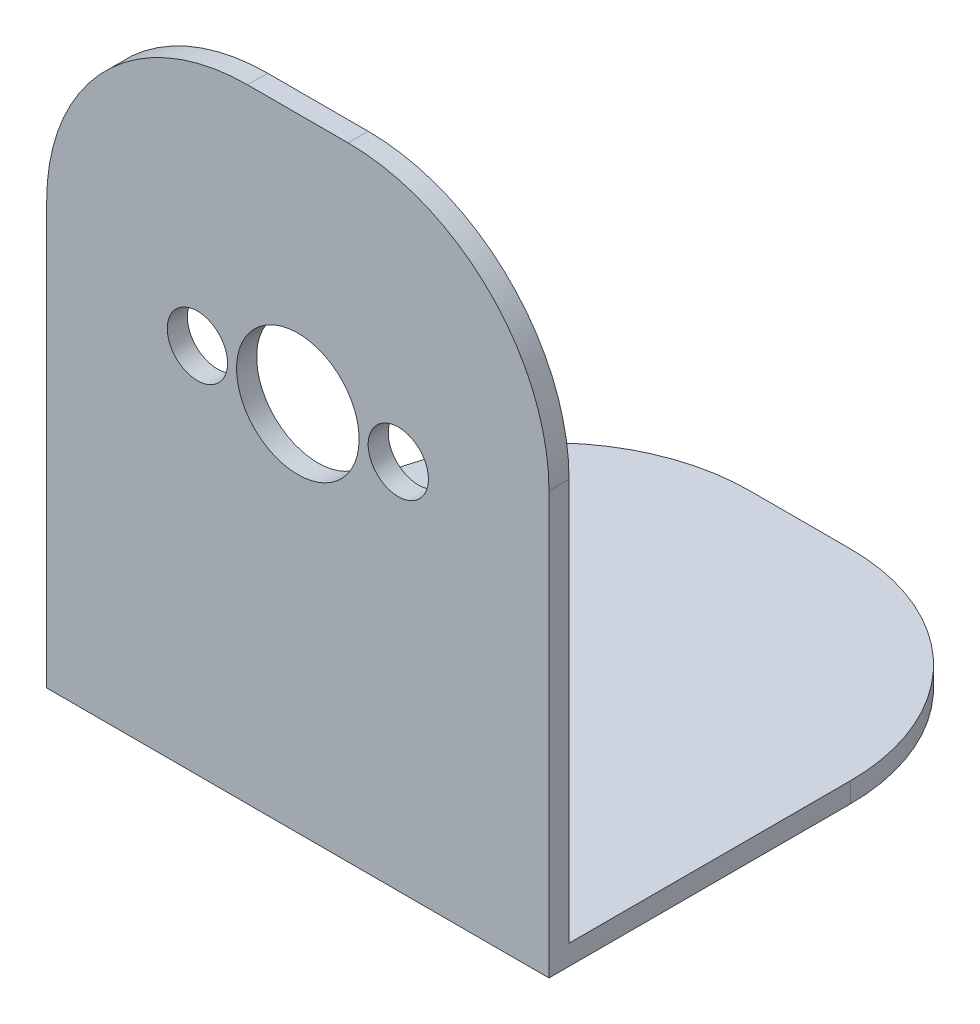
ISO-10303-21;
HEADER;
FILE_DESCRIPTION(('STEP AP214'),'2;1');
FILE_NAME('part.step','',(''),(''),'','','');
FILE_SCHEMA(('AUTOMOTIVE_DESIGN { 1 0 10303 214 1 1 1 1 }'));
ENDSEC;
DATA;
#1=APPLICATION_CONTEXT('core data for automotive mechanical design processes');
#2=APPLICATION_PROTOCOL_DEFINITION('international standard','automotive_design',2000,#1);
#3=PRODUCT_CONTEXT('',#1,'mechanical');
#4=PRODUCT('Part','Part','',(#3));
#5=PRODUCT_RELATED_PRODUCT_CATEGORY('part','',(#4));
#6=PRODUCT_DEFINITION_FORMATION('','',#4);
#7=PRODUCT_DEFINITION_CONTEXT('part definition',#1,'design');
#8=PRODUCT_DEFINITION('design','',#6,#7);
#9=PRODUCT_DEFINITION_SHAPE('','',#8);
#10=(LENGTH_UNIT() NAMED_UNIT(*) SI_UNIT(.MILLI.,.METRE.));
#11=(NAMED_UNIT(*) PLANE_ANGLE_UNIT() SI_UNIT($,.RADIAN.));
#12=(NAMED_UNIT(*) SI_UNIT($,.STERADIAN.) SOLID_ANGLE_UNIT());
#13=UNCERTAINTY_MEASURE_WITH_UNIT(LENGTH_MEASURE(1.E-05),#10,'distance_accuracy_value','');
#14=(GEOMETRIC_REPRESENTATION_CONTEXT(3) GLOBAL_UNCERTAINTY_ASSIGNED_CONTEXT((#13)) GLOBAL_UNIT_ASSIGNED_CONTEXT((#10,
#11,#12)) REPRESENTATION_CONTEXT('',''));
#15=CARTESIAN_POINT('',(0.,0.,0.));
#16=DIRECTION('',(0.,0.,1.));
#17=DIRECTION('',(1.,0.,0.));
#18=AXIS2_PLACEMENT_3D('',#15,#16,#17);
#19=CARTESIAN_POINT('',(0.,30.,1.));
#20=DIRECTION('',(0.,0.,-1.));
#21=DIRECTION('',(-1.,0.,0.));
#22=AXIS2_PLACEMENT_3D('',#19,#20,#21);
#23=PLANE('',#22);
#24=CARTESIAN_POINT('',(17.5,17.5,1.));
#25=DIRECTION('',(0.,0.,1.));
#26=DIRECTION('',(1.,0.,0.));
#27=AXIS2_PLACEMENT_3D('',#24,#25,#26);
#28=CIRCLE('',#27,1.5);
#29=CARTESIAN_POINT('',(19.,17.5,1.));
#30=VERTEX_POINT('',#29);
#31=EDGE_CURVE('E151',#30,#30,#28,.T.);
#32=ORIENTED_EDGE('',*,*,#31,.F.);
#33=EDGE_LOOP('',(#32));
#34=FACE_BOUND('',#33,.T.);
#35=DIRECTION('',(-1.,0.,0.));
#36=VECTOR('',#35,1.);
#37=CARTESIAN_POINT('',(0.,30.,1.));
#38=LINE('',#37,#36);
#39=CARTESIAN_POINT('',(15.,30.,1.));
#40=VERTEX_POINT('',#39);
#41=CARTESIAN_POINT('',(10.,30.,1.));
#42=VERTEX_POINT('',#41);
#43=EDGE_CURVE('E127',#40,#42,#38,.T.);
#44=ORIENTED_EDGE('',*,*,#43,.T.);
#45=CARTESIAN_POINT('',(10.,20.,1.));
#46=DIRECTION('',(0.,0.,-1.));
#47=DIRECTION('',(-1.,0.,0.));
#48=AXIS2_PLACEMENT_3D('',#45,#46,#47);
#49=CIRCLE('',#48,10.);
#50=CARTESIAN_POINT('',(0.,20.,1.));
#51=VERTEX_POINT('',#50);
#52=EDGE_CURVE('E11',#42,#51,#49,.F.);
#53=ORIENTED_EDGE('',*,*,#52,.T.);
#54=DIRECTION('',(0.,-1.,0.));
#55=VECTOR('',#54,1.);
#56=CARTESIAN_POINT('',(0.,0.,1.));
#57=LINE('',#56,#55);
#58=CARTESIAN_POINT('',(0.,-1.,1.));
#59=VERTEX_POINT('',#58);
#60=EDGE_CURVE('E128',#51,#59,#57,.T.);
#61=ORIENTED_EDGE('',*,*,#60,.T.);
#62=DIRECTION('',(-1.,0.,0.));
#63=VECTOR('',#62,1.);
#64=CARTESIAN_POINT('',(0.,-1.,1.));
#65=LINE('',#64,#63);
#66=CARTESIAN_POINT('',(25.,-1.,1.));
#67=VERTEX_POINT('',#66);
#68=EDGE_CURVE('E112',#67,#59,#65,.T.);
#69=ORIENTED_EDGE('',*,*,#68,.F.);
#70=DIRECTION('',(0.,1.,0.));
#71=VECTOR('',#70,1.);
#72=CARTESIAN_POINT('',(25.,0.,1.));
#73=LINE('',#72,#71);
#74=CARTESIAN_POINT('',(25.,20.,1.));
#75=VERTEX_POINT('',#74);
#76=EDGE_CURVE('E122',#67,#75,#73,.T.);
#77=ORIENTED_EDGE('',*,*,#76,.T.);
#78=CARTESIAN_POINT('',(15.,20.,1.));
#79=DIRECTION('',(0.,0.,-1.));
#80=DIRECTION('',(-1.,0.,0.));
#81=AXIS2_PLACEMENT_3D('',#78,#79,#80);
#82=CIRCLE('',#81,10.);
#83=EDGE_CURVE('E38',#75,#40,#82,.F.);
#84=ORIENTED_EDGE('',*,*,#83,.T.);
#85=EDGE_LOOP('',(#44,#53,#61,#69,#77,#84));
#86=FACE_BOUND('',#85,.T.);
#87=CARTESIAN_POINT('',(12.5,17.5,1.));
#88=DIRECTION('',(0.,0.,1.));
#89=DIRECTION('',(1.,0.,0.));
#90=AXIS2_PLACEMENT_3D('',#87,#88,#89);
#91=CIRCLE('',#90,3.05);
#92=CARTESIAN_POINT('',(15.55,17.5,1.));
#93=VERTEX_POINT('',#92);
#94=EDGE_CURVE('E157',#93,#93,#91,.T.);
#95=ORIENTED_EDGE('',*,*,#94,.F.);
#96=EDGE_LOOP('',(#95));
#97=FACE_BOUND('',#96,.T.);
#98=CARTESIAN_POINT('',(7.5,17.5,1.));
#99=DIRECTION('',(0.,0.,1.));
#100=DIRECTION('',(1.,0.,0.));
#101=AXIS2_PLACEMENT_3D('',#98,#99,#100);
#102=CIRCLE('',#101,1.5);
#103=CARTESIAN_POINT('',(9.,17.5,1.));
#104=VERTEX_POINT('',#103);
#105=EDGE_CURVE('E135',#104,#104,#102,.T.);
#106=ORIENTED_EDGE('',*,*,#105,.F.);
#107=EDGE_LOOP('',(#106));
#108=FACE_BOUND('',#107,.T.);
#109=ADVANCED_FACE('F30',(#34,#86,#97,#108),#23,.F.);
#110=CARTESIAN_POINT('',(0.,30.,0.));
#111=DIRECTION('',(0.,0.,-1.));
#112=DIRECTION('',(-1.,0.,0.));
#113=AXIS2_PLACEMENT_3D('',#110,#111,#112);
#114=PLANE('',#113);
#115=CARTESIAN_POINT('',(17.5,17.5,0.));
#116=DIRECTION('',(0.,0.,1.));
#117=DIRECTION('',(1.,0.,0.));
#118=AXIS2_PLACEMENT_3D('',#115,#116,#117);
#119=CIRCLE('',#118,1.5);
#120=CARTESIAN_POINT('',(19.,17.5,0.));
#121=VERTEX_POINT('',#120);
#122=EDGE_CURVE('E149',#121,#121,#119,.T.);
#123=ORIENTED_EDGE('',*,*,#122,.T.);
#124=EDGE_LOOP('',(#123));
#125=FACE_BOUND('',#124,.T.);
#126=DIRECTION('',(0.,-1.,0.));
#127=VECTOR('',#126,1.);
#128=CARTESIAN_POINT('',(0.,0.,0.));
#129=LINE('',#128,#127);
#130=CARTESIAN_POINT('',(0.,20.,0.));
#131=VERTEX_POINT('',#130);
#132=CARTESIAN_POINT('',(0.,0.,0.));
#133=VERTEX_POINT('',#132);
#134=EDGE_CURVE('E160',#131,#133,#129,.T.);
#135=ORIENTED_EDGE('',*,*,#134,.F.);
#136=CARTESIAN_POINT('',(10.,20.,0.));
#137=DIRECTION('',(0.,0.,-1.));
#138=DIRECTION('',(-1.,0.,0.));
#139=AXIS2_PLACEMENT_3D('',#136,#137,#138);
#140=CIRCLE('',#139,10.);
#141=CARTESIAN_POINT('',(10.,30.,0.));
#142=VERTEX_POINT('',#141);
#143=EDGE_CURVE('E198',#131,#142,#140,.T.);
#144=ORIENTED_EDGE('',*,*,#143,.T.);
#145=DIRECTION('',(-1.,0.,0.));
#146=VECTOR('',#145,1.);
#147=CARTESIAN_POINT('',(0.,30.,0.));
#148=LINE('',#147,#146);
#149=CARTESIAN_POINT('',(15.,30.,0.));
#150=VERTEX_POINT('',#149);
#151=EDGE_CURVE('E163',#150,#142,#148,.T.);
#152=ORIENTED_EDGE('',*,*,#151,.F.);
#153=CARTESIAN_POINT('',(15.,20.,0.));
#154=DIRECTION('',(0.,0.,-1.));
#155=DIRECTION('',(-1.,0.,0.));
#156=AXIS2_PLACEMENT_3D('',#153,#154,#155);
#157=CIRCLE('',#156,10.);
#158=CARTESIAN_POINT('',(25.,20.,0.));
#159=VERTEX_POINT('',#158);
#160=EDGE_CURVE('E196',#150,#159,#157,.T.);
#161=ORIENTED_EDGE('',*,*,#160,.T.);
#162=DIRECTION('',(0.,1.,0.));
#163=VECTOR('',#162,1.);
#164=CARTESIAN_POINT('',(25.,0.,0.));
#165=LINE('',#164,#163);
#166=CARTESIAN_POINT('',(25.,0.,0.));
#167=VERTEX_POINT('',#166);
#168=EDGE_CURVE('E175',#167,#159,#165,.T.);
#169=ORIENTED_EDGE('',*,*,#168,.F.);
#170=DIRECTION('',(1.,0.,0.));
#171=VECTOR('',#170,1.);
#172=CARTESIAN_POINT('',(0.,0.,0.));
#173=LINE('',#172,#171);
#174=EDGE_CURVE('E171',#133,#167,#173,.T.);
#175=ORIENTED_EDGE('',*,*,#174,.F.);
#176=EDGE_LOOP('',(#135,#144,#152,#161,#169,#175));
#177=FACE_BOUND('',#176,.T.);
#178=CARTESIAN_POINT('',(12.5,17.5,0.));
#179=DIRECTION('',(0.,0.,1.));
#180=DIRECTION('',(1.,0.,0.));
#181=AXIS2_PLACEMENT_3D('',#178,#179,#180);
#182=CIRCLE('',#181,3.05);
#183=CARTESIAN_POINT('',(15.55,17.5,0.));
#184=VERTEX_POINT('',#183);
#185=EDGE_CURVE('E154',#184,#184,#182,.T.);
#186=ORIENTED_EDGE('',*,*,#185,.T.);
#187=EDGE_LOOP('',(#186));
#188=FACE_BOUND('',#187,.T.);
#189=CARTESIAN_POINT('',(7.5,17.5,0.));
#190=DIRECTION('',(0.,0.,1.));
#191=DIRECTION('',(1.,0.,0.));
#192=AXIS2_PLACEMENT_3D('',#189,#190,#191);
#193=CIRCLE('',#192,1.5);
#194=CARTESIAN_POINT('',(9.,17.5,0.));
#195=VERTEX_POINT('',#194);
#196=EDGE_CURVE('E132',#195,#195,#193,.T.);
#197=ORIENTED_EDGE('',*,*,#196,.T.);
#198=EDGE_LOOP('',(#197));
#199=FACE_BOUND('',#198,.T.);
#200=ADVANCED_FACE('F209',(#125,#177,#188,#199),#114,.T.);
#201=CARTESIAN_POINT('',(0.,0.,1.));
#202=DIRECTION('',(1.,0.,0.));
#203=DIRECTION('',(0.,0.,-1.));
#204=AXIS2_PLACEMENT_3D('',#201,#202,#203);
#205=PLANE('',#204);
#206=DIRECTION('',(0.,0.,-1.));
#207=VECTOR('',#206,1.);
#208=CARTESIAN_POINT('',(0.,0.,1.));
#209=LINE('',#208,#207);
#210=CARTESIAN_POINT('',(0.,0.,-14.));
#211=VERTEX_POINT('',#210);
#212=EDGE_CURVE('E144',#133,#211,#209,.T.);
#213=ORIENTED_EDGE('',*,*,#212,.T.);
#214=DIRECTION('',(0.,1.,0.));
#215=VECTOR('',#214,1.);
#216=CARTESIAN_POINT('',(0.,0.,-14.));
#217=LINE('',#216,#215);
#218=CARTESIAN_POINT('',(0.,-1.,-14.));
#219=VERTEX_POINT('',#218);
#220=EDGE_CURVE('E188',#211,#219,#217,.F.);
#221=ORIENTED_EDGE('',*,*,#220,.T.);
#222=DIRECTION('',(0.,0.,-1.));
#223=VECTOR('',#222,1.);
#224=CARTESIAN_POINT('',(0.,-1.,1.));
#225=LINE('',#224,#223);
#226=EDGE_CURVE('E258',#59,#219,#225,.T.);
#227=ORIENTED_EDGE('',*,*,#226,.F.);
#228=ORIENTED_EDGE('',*,*,#60,.F.);
#229=DIRECTION('',(0.,0.,-1.));
#230=VECTOR('',#229,1.);
#231=CARTESIAN_POINT('',(0.,20.,1.));
#232=LINE('',#231,#230);
#233=EDGE_CURVE('E185',#51,#131,#232,.T.);
#234=ORIENTED_EDGE('',*,*,#233,.T.);
#235=ORIENTED_EDGE('',*,*,#134,.T.);
#236=EDGE_LOOP('',(#213,#221,#227,#228,#234,#235));
#237=FACE_BOUND('',#236,.T.);
#238=ADVANCED_FACE('F228',(#237),#205,.F.);
#239=CARTESIAN_POINT('',(25.,0.,1.));
#240=DIRECTION('',(-1.,0.,0.));
#241=DIRECTION('',(0.,0.,1.));
#242=AXIS2_PLACEMENT_3D('',#239,#240,#241);
#243=PLANE('',#242);
#244=DIRECTION('',(0.,0.,1.));
#245=VECTOR('',#244,1.);
#246=CARTESIAN_POINT('',(25.,-1.,1.));
#247=LINE('',#246,#245);
#248=CARTESIAN_POINT('',(25.,-1.,-14.));
#249=VERTEX_POINT('',#248);
#250=EDGE_CURVE('E107',#249,#67,#247,.T.);
#251=ORIENTED_EDGE('',*,*,#250,.F.);
#252=DIRECTION('',(0.,1.,0.));
#253=VECTOR('',#252,1.);
#254=CARTESIAN_POINT('',(25.,0.,-14.));
#255=LINE('',#254,#253);
#256=CARTESIAN_POINT('',(25.,0.,-14.));
#257=VERTEX_POINT('',#256);
#258=EDGE_CURVE('E194',#249,#257,#255,.T.);
#259=ORIENTED_EDGE('',*,*,#258,.T.);
#260=DIRECTION('',(0.,0.,1.));
#261=VECTOR('',#260,1.);
#262=CARTESIAN_POINT('',(25.,0.,1.));
#263=LINE('',#262,#261);
#264=EDGE_CURVE('E213',#257,#167,#263,.T.);
#265=ORIENTED_EDGE('',*,*,#264,.T.);
#266=ORIENTED_EDGE('',*,*,#168,.T.);
#267=DIRECTION('',(0.,0.,-1.));
#268=VECTOR('',#267,1.);
#269=CARTESIAN_POINT('',(25.,20.,1.));
#270=LINE('',#269,#268);
#271=EDGE_CURVE('E126',#159,#75,#270,.F.);
#272=ORIENTED_EDGE('',*,*,#271,.T.);
#273=ORIENTED_EDGE('',*,*,#76,.F.);
#274=EDGE_LOOP('',(#251,#259,#265,#266,#272,#273));
#275=FACE_BOUND('',#274,.T.);
#276=ADVANCED_FACE('F123',(#275),#243,.F.);
#277=CARTESIAN_POINT('',(0.,30.,1.));
#278=DIRECTION('',(0.,-1.,0.));
#279=DIRECTION('',(0.,0.,-1.));
#280=AXIS2_PLACEMENT_3D('',#277,#278,#279);
#281=PLANE('',#280);
#282=ORIENTED_EDGE('',*,*,#151,.T.);
#283=DIRECTION('',(0.,0.,-1.));
#284=VECTOR('',#283,1.);
#285=CARTESIAN_POINT('',(10.,30.,1.));
#286=LINE('',#285,#284);
#287=EDGE_CURVE('E45',#142,#42,#286,.F.);
#288=ORIENTED_EDGE('',*,*,#287,.T.);
#289=ORIENTED_EDGE('',*,*,#43,.F.);
#290=DIRECTION('',(0.,0.,-1.));
#291=VECTOR('',#290,1.);
#292=CARTESIAN_POINT('',(15.,30.,1.));
#293=LINE('',#292,#291);
#294=EDGE_CURVE('E200',#40,#150,#293,.T.);
#295=ORIENTED_EDGE('',*,*,#294,.T.);
#296=EDGE_LOOP('',(#282,#288,#289,#295));
#297=FACE_BOUND('',#296,.T.);
#298=ADVANCED_FACE('F205',(#297),#281,.F.);
#299=CARTESIAN_POINT('',(12.5,17.5,1.));
#300=DIRECTION('',(0.,0.,-1.));
#301=DIRECTION('',(-1.,0.,0.));
#302=AXIS2_PLACEMENT_3D('',#299,#300,#301);
#303=CYLINDRICAL_SURFACE('',#302,3.05);
#304=ORIENTED_EDGE('',*,*,#94,.T.);
#305=EDGE_LOOP('',(#304));
#306=FACE_BOUND('',#305,.T.);
#307=ORIENTED_EDGE('',*,*,#185,.F.);
#308=EDGE_LOOP('',(#307));
#309=FACE_BOUND('',#308,.T.);
#310=ADVANCED_FACE('F233',(#306,#309),#303,.F.);
#311=CARTESIAN_POINT('',(17.5,17.5,1.));
#312=DIRECTION('',(0.,0.,-1.));
#313=DIRECTION('',(-1.,0.,0.));
#314=AXIS2_PLACEMENT_3D('',#311,#312,#313);
#315=CYLINDRICAL_SURFACE('',#314,1.5);
#316=ORIENTED_EDGE('',*,*,#31,.T.);
#317=EDGE_LOOP('',(#316));
#318=FACE_BOUND('',#317,.T.);
#319=ORIENTED_EDGE('',*,*,#122,.F.);
#320=EDGE_LOOP('',(#319));
#321=FACE_BOUND('',#320,.T.);
#322=ADVANCED_FACE('F282',(#318,#321),#315,.F.);
#323=CARTESIAN_POINT('',(7.5,17.5,1.));
#324=DIRECTION('',(0.,0.,-1.));
#325=DIRECTION('',(-1.,0.,0.));
#326=AXIS2_PLACEMENT_3D('',#323,#324,#325);
#327=CYLINDRICAL_SURFACE('',#326,1.5);
#328=ORIENTED_EDGE('',*,*,#105,.T.);
#329=EDGE_LOOP('',(#328));
#330=FACE_BOUND('',#329,.T.);
#331=ORIENTED_EDGE('',*,*,#196,.F.);
#332=EDGE_LOOP('',(#331));
#333=FACE_BOUND('',#332,.T.);
#334=ADVANCED_FACE('F278',(#330,#333),#327,.F.);
#335=CARTESIAN_POINT('',(0.,0.,-24.));
#336=DIRECTION('',(0.,-1.,0.));
#337=DIRECTION('',(0.,0.,-1.));
#338=AXIS2_PLACEMENT_3D('',#335,#336,#337);
#339=PLANE('',#338);
#340=DIRECTION('',(1.,0.,0.));
#341=VECTOR('',#340,1.);
#342=CARTESIAN_POINT('',(0.,0.,-24.));
#343=LINE('',#342,#341);
#344=CARTESIAN_POINT('',(10.,0.,-24.));
#345=VERTEX_POINT('',#344);
#346=CARTESIAN_POINT('',(15.,0.,-24.));
#347=VERTEX_POINT('',#346);
#348=EDGE_CURVE('E141',#345,#347,#343,.T.);
#349=ORIENTED_EDGE('',*,*,#348,.F.);
#350=CARTESIAN_POINT('',(10.,0.,-14.));
#351=DIRECTION('',(0.,-1.,0.));
#352=DIRECTION('',(0.,0.,-1.));
#353=AXIS2_PLACEMENT_3D('',#350,#351,#352);
#354=CIRCLE('',#353,10.);
#355=EDGE_CURVE('E183',#345,#211,#354,.F.);
#356=ORIENTED_EDGE('',*,*,#355,.T.);
#357=ORIENTED_EDGE('',*,*,#212,.F.);
#358=ORIENTED_EDGE('',*,*,#174,.T.);
#359=ORIENTED_EDGE('',*,*,#264,.F.);
#360=CARTESIAN_POINT('',(15.,0.,-14.));
#361=DIRECTION('',(0.,-1.,0.));
#362=DIRECTION('',(0.,0.,-1.));
#363=AXIS2_PLACEMENT_3D('',#360,#361,#362);
#364=CIRCLE('',#363,10.);
#365=EDGE_CURVE('E252',#257,#347,#364,.F.);
#366=ORIENTED_EDGE('',*,*,#365,.T.);
#367=EDGE_LOOP('',(#349,#356,#357,#358,#359,#366));
#368=FACE_BOUND('',#367,.T.);
#369=ADVANCED_FACE('F255',(#368),#339,.F.);
#370=CARTESIAN_POINT('',(0.,-1.,-24.));
#371=DIRECTION('',(0.,0.,1.));
#372=DIRECTION('',(1.,0.,0.));
#373=AXIS2_PLACEMENT_3D('',#370,#371,#372);
#374=PLANE('',#373);
#375=DIRECTION('',(1.,0.,0.));
#376=VECTOR('',#375,1.);
#377=CARTESIAN_POINT('',(0.,-1.,-24.));
#378=LINE('',#377,#376);
#379=CARTESIAN_POINT('',(10.,-1.,-24.));
#380=VERTEX_POINT('',#379);
#381=CARTESIAN_POINT('',(15.,-1.,-24.));
#382=VERTEX_POINT('',#381);
#383=EDGE_CURVE('E120',#380,#382,#378,.T.);
#384=ORIENTED_EDGE('',*,*,#383,.F.);
#385=DIRECTION('',(0.,1.,0.));
#386=VECTOR('',#385,1.);
#387=CARTESIAN_POINT('',(10.,-1.,-24.));
#388=LINE('',#387,#386);
#389=EDGE_CURVE('E261',#380,#345,#388,.T.);
#390=ORIENTED_EDGE('',*,*,#389,.T.);
#391=ORIENTED_EDGE('',*,*,#348,.T.);
#392=DIRECTION('',(0.,1.,0.));
#393=VECTOR('',#392,1.);
#394=CARTESIAN_POINT('',(15.,-1.,-24.));
#395=LINE('',#394,#393);
#396=EDGE_CURVE('E166',#347,#382,#395,.F.);
#397=ORIENTED_EDGE('',*,*,#396,.T.);
#398=EDGE_LOOP('',(#384,#390,#391,#397));
#399=FACE_BOUND('',#398,.T.);
#400=ADVANCED_FACE('F266',(#399),#374,.F.);
#401=CARTESIAN_POINT('',(0.,-1.,-24.));
#402=DIRECTION('',(0.,-1.,0.));
#403=DIRECTION('',(0.,0.,-1.));
#404=AXIS2_PLACEMENT_3D('',#401,#402,#403);
#405=PLANE('',#404);
#406=ORIENTED_EDGE('',*,*,#226,.T.);
#407=CARTESIAN_POINT('',(10.,-1.,-14.));
#408=DIRECTION('',(0.,-1.,0.));
#409=DIRECTION('',(0.,0.,-1.));
#410=AXIS2_PLACEMENT_3D('',#407,#408,#409);
#411=CIRCLE('',#410,10.);
#412=EDGE_CURVE('E191',#219,#380,#411,.T.);
#413=ORIENTED_EDGE('',*,*,#412,.T.);
#414=ORIENTED_EDGE('',*,*,#383,.T.);
#415=CARTESIAN_POINT('',(15.,-1.,-14.));
#416=DIRECTION('',(0.,-1.,0.));
#417=DIRECTION('',(0.,0.,-1.));
#418=AXIS2_PLACEMENT_3D('',#415,#416,#417);
#419=CIRCLE('',#418,10.);
#420=EDGE_CURVE('E116',#382,#249,#419,.T.);
#421=ORIENTED_EDGE('',*,*,#420,.T.);
#422=ORIENTED_EDGE('',*,*,#250,.T.);
#423=ORIENTED_EDGE('',*,*,#68,.T.);
#424=EDGE_LOOP('',(#406,#413,#414,#421,#422,#423));
#425=FACE_BOUND('',#424,.T.);
#426=ADVANCED_FACE('F110',(#425),#405,.T.);
#427=CARTESIAN_POINT('',(10.,-1.,-14.));
#428=DIRECTION('',(0.,1.,0.));
#429=DIRECTION('',(0.,0.,1.));
#430=AXIS2_PLACEMENT_3D('',#427,#428,#429);
#431=CYLINDRICAL_SURFACE('',#430,10.);
#432=ORIENTED_EDGE('',*,*,#412,.F.);
#433=ORIENTED_EDGE('',*,*,#220,.F.);
#434=ORIENTED_EDGE('',*,*,#355,.F.);
#435=ORIENTED_EDGE('',*,*,#389,.F.);
#436=EDGE_LOOP('',(#432,#433,#434,#435));
#437=FACE_BOUND('',#436,.T.);
#438=ADVANCED_FACE('F243',(#437),#431,.T.);
#439=CARTESIAN_POINT('',(15.,0.,-14.));
#440=DIRECTION('',(0.,1.,0.));
#441=DIRECTION('',(0.,0.,1.));
#442=AXIS2_PLACEMENT_3D('',#439,#440,#441);
#443=CYLINDRICAL_SURFACE('',#442,10.);
#444=ORIENTED_EDGE('',*,*,#420,.F.);
#445=ORIENTED_EDGE('',*,*,#396,.F.);
#446=ORIENTED_EDGE('',*,*,#365,.F.);
#447=ORIENTED_EDGE('',*,*,#258,.F.);
#448=EDGE_LOOP('',(#444,#445,#446,#447));
#449=FACE_BOUND('',#448,.T.);
#450=ADVANCED_FACE('F220',(#449),#443,.T.);
#451=CARTESIAN_POINT('',(10.,20.,1.));
#452=DIRECTION('',(0.,0.,-1.));
#453=DIRECTION('',(-1.,0.,0.));
#454=AXIS2_PLACEMENT_3D('',#451,#452,#453);
#455=CYLINDRICAL_SURFACE('',#454,10.);
#456=ORIENTED_EDGE('',*,*,#52,.F.);
#457=ORIENTED_EDGE('',*,*,#287,.F.);
#458=ORIENTED_EDGE('',*,*,#143,.F.);
#459=ORIENTED_EDGE('',*,*,#233,.F.);
#460=EDGE_LOOP('',(#456,#457,#458,#459));
#461=FACE_BOUND('',#460,.T.);
#462=ADVANCED_FACE('F216',(#461),#455,.T.);
#463=CARTESIAN_POINT('',(15.,20.,1.));
#464=DIRECTION('',(0.,0.,-1.));
#465=DIRECTION('',(-1.,0.,0.));
#466=AXIS2_PLACEMENT_3D('',#463,#464,#465);
#467=CYLINDRICAL_SURFACE('',#466,10.);
#468=ORIENTED_EDGE('',*,*,#83,.F.);
#469=ORIENTED_EDGE('',*,*,#271,.F.);
#470=ORIENTED_EDGE('',*,*,#160,.F.);
#471=ORIENTED_EDGE('',*,*,#294,.F.);
#472=EDGE_LOOP('',(#468,#469,#470,#471));
#473=FACE_BOUND('',#472,.T.);
#474=ADVANCED_FACE('F32',(#473),#467,.T.);
#475=CLOSED_SHELL('',(#109,#200,#238,#276,#298,#310,#322,#334,#369,#400,#426,#438,#450,#462,#474));
#476=MANIFOLD_SOLID_BREP('B2',#475);
#477=ADVANCED_BREP_SHAPE_REPRESENTATION('',(#18,#476),#14);
#478=SHAPE_DEFINITION_REPRESENTATION(#9,#477);
ENDSEC;
END-ISO-10303-21;
